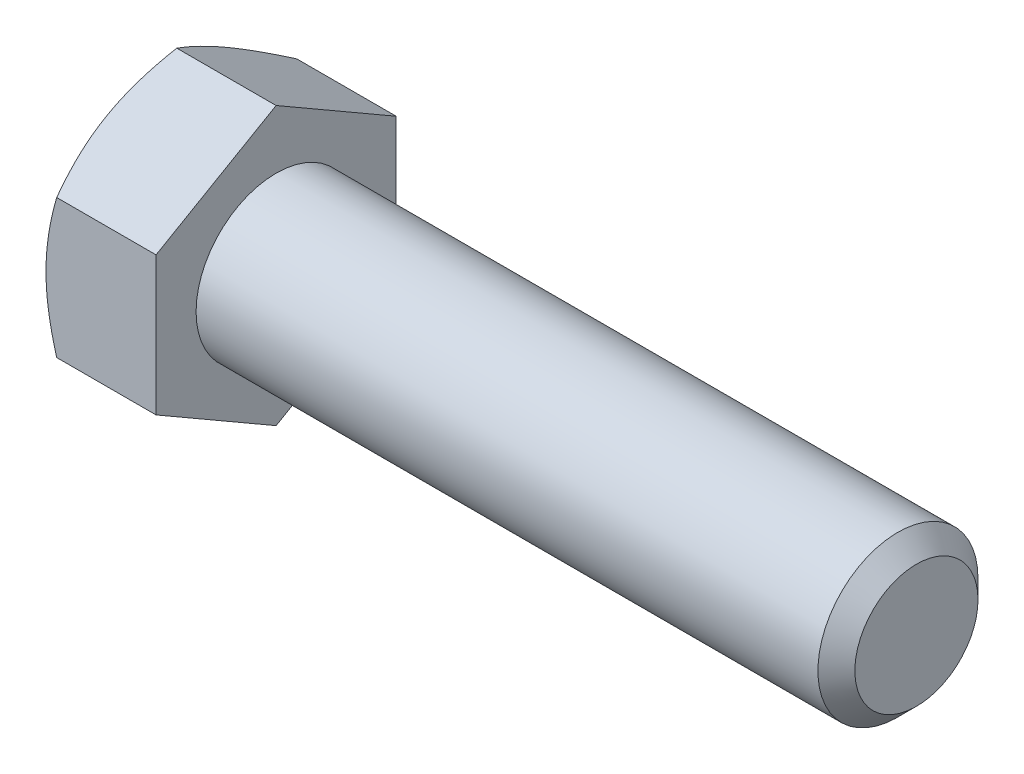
from build123d import *

# Parameters (mm, degrees)
SKETCH5_R           = 6.35
BOSS_EXTRUDE3_DEPTH = 50.8
CHAMFER1_SIZE       = 1.465384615
BOSS_EXTRUDE4_DEPTH = 8.73125
SKETCH8_OUTSIDE_W   = 250.058
SKETCH8_OUTSIDE_H   = 253.006
SKETCH8_OUTSIDE_R   = 9.525
CUT_EXTRUDE3_DEPTH  = 62.283463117
CUT_EXTRUDE3_DRAFT  = -60


with BuildPart() as part:
    # Sketch5 → Boss-Extrude3 (new body)
    with BuildSketch(Plane(origin=(29.765625, 0, 0), x_dir=(0, 0, -1), z_dir=(1, 0, 0))):
        Circle(SKETCH5_R)
    extrude(amount=-BOSS_EXTRUDE3_DEPTH)

    # Chamfer1
    chamfer1_edges = [part.edges().sort_by_distance(p)[0] for p in [
        (29.765625, 0, 6.35),
    ]]
    chamfer(chamfer1_edges, length=CHAMFER1_SIZE)

    # Sketch6 → Boss-Extrude4 (add)
    with BuildSketch(Plane.ZY.offset(21.034375)):
        Polygon((9.525, 5.499261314), (0, 10.998522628), (-9.525, 5.499261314), (-9.525, -5.499261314), (0, -10.998522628), (9.525, -5.499261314), align=None)
    extrude(amount=BOSS_EXTRUDE4_DEPTH)


with BuildPart() as cut_extrude3_tool:
    # Sketch8 outside → Cut-Extrude3 (with draft: the straight prism first)
    with BuildSketch(Plane.ZY.offset(29.765625)):
        Rectangle(SKETCH8_OUTSIDE_W, SKETCH8_OUTSIDE_H)
        Circle(SKETCH8_OUTSIDE_R, mode=Mode.SUBTRACT)
    extrude(amount=-CUT_EXTRUDE3_DEPTH)
    # Cut-Extrude3: the draft: its side faces are tilted about the plane it starts from
    cut_extrude3_sides = [cut_extrude3_tool.faces().sort_by_distance(p)[0] for p in [
        (1.376106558, -126.503, 0),
        (1.376106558, 0, 125.029),
        (1.376106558, 126.503, 0),
        (1.376106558, 0, -125.029),
        (1.376106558, 0, -9.525),
    ]]
    draft(cut_extrude3_sides, Plane.ZY.offset(29.765625), CUT_EXTRUDE3_DRAFT)


with BuildPart() as part_1:
    add(part.part)

    # Cut-Extrude3: cut by cut_extrude3_tool
    add(cut_extrude3_tool.part, mode=Mode.SUBTRACT)


solid = part_1.part
